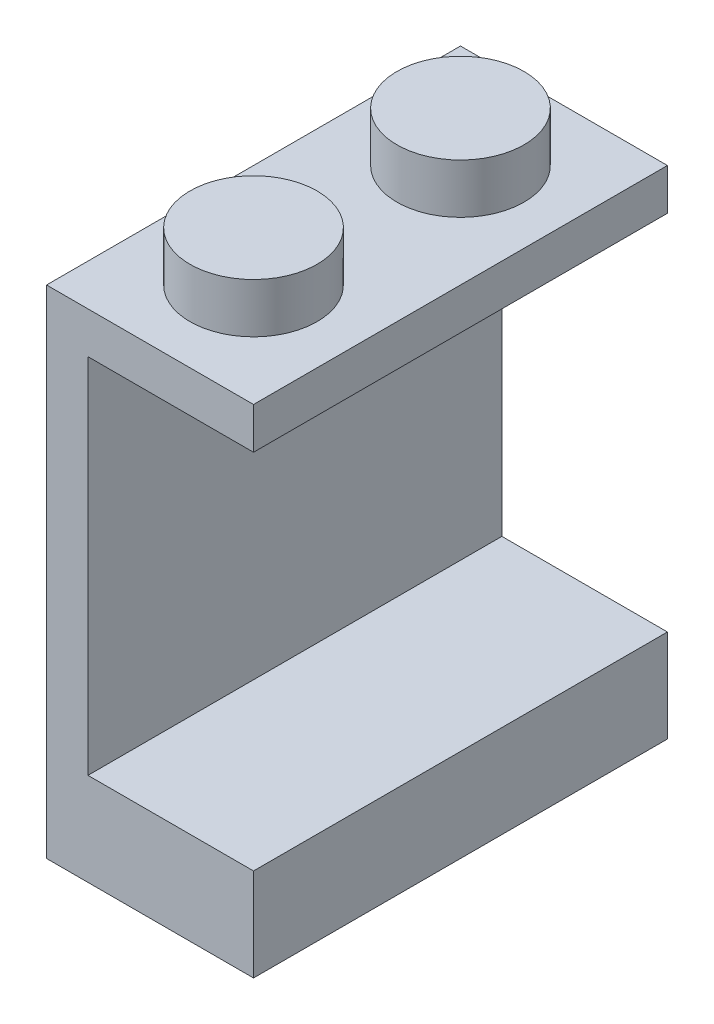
ISO-10303-21;
HEADER;
FILE_DESCRIPTION(('STEP AP214'),'2;1');
FILE_NAME('part.step','',(''),(''),'','','');
FILE_SCHEMA(('AUTOMOTIVE_DESIGN { 1 0 10303 214 1 1 1 1 }'));
ENDSEC;
DATA;
#1=APPLICATION_CONTEXT('core data for automotive mechanical design processes');
#2=APPLICATION_PROTOCOL_DEFINITION('international standard','automotive_design',2000,#1);
#3=PRODUCT_CONTEXT('',#1,'mechanical');
#4=PRODUCT('Part','Part','',(#3));
#5=PRODUCT_RELATED_PRODUCT_CATEGORY('part','',(#4));
#6=PRODUCT_DEFINITION_FORMATION('','',#4);
#7=PRODUCT_DEFINITION_CONTEXT('part definition',#1,'design');
#8=PRODUCT_DEFINITION('design','',#6,#7);
#9=PRODUCT_DEFINITION_SHAPE('','',#8);
#10=(LENGTH_UNIT() NAMED_UNIT(*) SI_UNIT(.MILLI.,.METRE.));
#11=(NAMED_UNIT(*) PLANE_ANGLE_UNIT() SI_UNIT($,.RADIAN.));
#12=(NAMED_UNIT(*) SI_UNIT($,.STERADIAN.) SOLID_ANGLE_UNIT());
#13=UNCERTAINTY_MEASURE_WITH_UNIT(LENGTH_MEASURE(1.E-05),#10,'distance_accuracy_value','');
#14=(GEOMETRIC_REPRESENTATION_CONTEXT(3) GLOBAL_UNCERTAINTY_ASSIGNED_CONTEXT((#13)) GLOBAL_UNIT_ASSIGNED_CONTEXT((#10,
#11,#12)) REPRESENTATION_CONTEXT('',''));
#15=CARTESIAN_POINT('',(0.,0.,0.));
#16=DIRECTION('',(0.,0.,1.));
#17=DIRECTION('',(1.,0.,0.));
#18=AXIS2_PLACEMENT_3D('',#15,#16,#17);
#19=CARTESIAN_POINT('',(3.96875,19.05,7.9375));
#20=DIRECTION('',(-1.,0.,0.));
#21=DIRECTION('',(0.,0.,1.));
#22=AXIS2_PLACEMENT_3D('',#19,#20,#21);
#23=PLANE('',#22);
#24=DIRECTION('',(0.,-1.,0.));
#25=VECTOR('',#24,1.);
#26=CARTESIAN_POINT('',(3.96875,19.05,-7.9375));
#27=LINE('',#26,#25);
#28=CARTESIAN_POINT('',(3.96875,3.556,-7.9375));
#29=VERTEX_POINT('',#28);
#30=CARTESIAN_POINT('',(3.96875,0.,-7.9375));
#31=VERTEX_POINT('',#30);
#32=EDGE_CURVE('E144',#29,#31,#27,.T.);
#33=ORIENTED_EDGE('',*,*,#32,.F.);
#34=DIRECTION('',(0.,0.,1.));
#35=VECTOR('',#34,1.);
#36=CARTESIAN_POINT('',(3.96875,3.556,-7.9375));
#37=LINE('',#36,#35);
#38=CARTESIAN_POINT('',(3.96875,3.556,7.93749999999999));
#39=VERTEX_POINT('',#38);
#40=EDGE_CURVE('E130',#29,#39,#37,.T.);
#41=ORIENTED_EDGE('',*,*,#40,.T.);
#42=DIRECTION('',(0.,-1.,0.));
#43=VECTOR('',#42,1.);
#44=CARTESIAN_POINT('',(3.96875,19.05,7.9375));
#45=LINE('',#44,#43);
#46=CARTESIAN_POINT('',(3.96875,0.,7.9375));
#47=VERTEX_POINT('',#46);
#48=EDGE_CURVE('E142',#39,#47,#45,.T.);
#49=ORIENTED_EDGE('',*,*,#48,.T.);
#50=DIRECTION('',(0.,0.,-1.));
#51=VECTOR('',#50,1.);
#52=CARTESIAN_POINT('',(3.96875,0.,7.9375));
#53=LINE('',#52,#51);
#54=EDGE_CURVE('E494',#47,#31,#53,.T.);
#55=ORIENTED_EDGE('',*,*,#54,.T.);
#56=EDGE_LOOP('',(#33,#41,#49,#55));
#57=FACE_BOUND('',#56,.T.);
#58=ADVANCED_FACE('F38',(#57),#23,.F.);
#59=CARTESIAN_POINT('',(-3.96875,19.05,7.9375));
#60=DIRECTION('',(0.,-1.,0.));
#61=DIRECTION('',(0.,0.,-1.));
#62=AXIS2_PLACEMENT_3D('',#59,#60,#61);
#63=PLANE('',#62);
#64=CARTESIAN_POINT('',(0.,19.05,3.96875));
#65=DIRECTION('',(0.,-1.,0.));
#66=DIRECTION('',(0.,0.,-1.));
#67=AXIS2_PLACEMENT_3D('',#64,#65,#66);
#68=CIRCLE('',#67,2.4384);
#69=CARTESIAN_POINT('',(0.,19.05,1.53035));
#70=VERTEX_POINT('',#69);
#71=EDGE_CURVE('E161',#70,#70,#68,.F.);
#72=ORIENTED_EDGE('',*,*,#71,.F.);
#73=EDGE_LOOP('',(#72));
#74=FACE_BOUND('',#73,.T.);
#75=DIRECTION('',(0.,0.,1.));
#76=VECTOR('',#75,1.);
#77=CARTESIAN_POINT('',(-3.96875,19.05,-7.9375));
#78=LINE('',#77,#76);
#79=CARTESIAN_POINT('',(-3.96875,19.05,-7.9375));
#80=VERTEX_POINT('',#79);
#81=CARTESIAN_POINT('',(-3.96875,19.05,7.9375));
#82=VERTEX_POINT('',#81);
#83=EDGE_CURVE('E499',#80,#82,#78,.T.);
#84=ORIENTED_EDGE('',*,*,#83,.T.);
#85=DIRECTION('',(-1.,0.,0.));
#86=VECTOR('',#85,1.);
#87=CARTESIAN_POINT('',(3.96875,19.05,7.9375));
#88=LINE('',#87,#86);
#89=CARTESIAN_POINT('',(3.96875,19.05,7.9375));
#90=VERTEX_POINT('',#89);
#91=EDGE_CURVE('E501',#90,#82,#88,.T.);
#92=ORIENTED_EDGE('',*,*,#91,.F.);
#93=DIRECTION('',(0.,0.,-1.));
#94=VECTOR('',#93,1.);
#95=CARTESIAN_POINT('',(3.96875,19.05,7.9375));
#96=LINE('',#95,#94);
#97=CARTESIAN_POINT('',(3.96875,19.05,-7.9375));
#98=VERTEX_POINT('',#97);
#99=EDGE_CURVE('E504',#90,#98,#96,.T.);
#100=ORIENTED_EDGE('',*,*,#99,.T.);
#101=DIRECTION('',(1.,0.,0.));
#102=VECTOR('',#101,1.);
#103=CARTESIAN_POINT('',(-3.96875,19.05,-7.9375));
#104=LINE('',#103,#102);
#105=EDGE_CURVE('E506',#80,#98,#104,.T.);
#106=ORIENTED_EDGE('',*,*,#105,.F.);
#107=EDGE_LOOP('',(#84,#92,#100,#106));
#108=FACE_BOUND('',#107,.T.);
#109=CARTESIAN_POINT('',(0.,19.05,-3.96875));
#110=DIRECTION('',(0.,-1.,0.));
#111=DIRECTION('',(0.,0.,-1.));
#112=AXIS2_PLACEMENT_3D('',#109,#110,#111);
#113=CIRCLE('',#112,2.4384);
#114=CARTESIAN_POINT('',(0.,19.05,-6.40715));
#115=VERTEX_POINT('',#114);
#116=EDGE_CURVE('E46',#115,#115,#113,.F.);
#117=ORIENTED_EDGE('',*,*,#116,.F.);
#118=EDGE_LOOP('',(#117));
#119=FACE_BOUND('',#118,.T.);
#120=ADVANCED_FACE('F168',(#74,#108,#119),#63,.F.);
#121=CARTESIAN_POINT('',(-3.96875,19.05,-7.9375));
#122=DIRECTION('',(1.,0.,0.));
#123=DIRECTION('',(0.,0.,-1.));
#124=AXIS2_PLACEMENT_3D('',#121,#122,#123);
#125=PLANE('',#124);
#126=DIRECTION('',(0.,0.,1.));
#127=VECTOR('',#126,1.);
#128=CARTESIAN_POINT('',(-3.96875,0.,-7.9375));
#129=LINE('',#128,#127);
#130=CARTESIAN_POINT('',(-3.96875,0.,-7.9375));
#131=VERTEX_POINT('',#130);
#132=CARTESIAN_POINT('',(-3.96875,0.,7.9375));
#133=VERTEX_POINT('',#132);
#134=EDGE_CURVE('E490',#131,#133,#129,.T.);
#135=ORIENTED_EDGE('',*,*,#134,.T.);
#136=DIRECTION('',(0.,-1.,0.));
#137=VECTOR('',#136,1.);
#138=CARTESIAN_POINT('',(-3.96875,19.05,7.9375));
#139=LINE('',#138,#137);
#140=EDGE_CURVE('E155',#82,#133,#139,.T.);
#141=ORIENTED_EDGE('',*,*,#140,.F.);
#142=ORIENTED_EDGE('',*,*,#83,.F.);
#143=DIRECTION('',(0.,-1.,0.));
#144=VECTOR('',#143,1.);
#145=CARTESIAN_POINT('',(-3.96875,19.05,-7.9375));
#146=LINE('',#145,#144);
#147=EDGE_CURVE('E508',#80,#131,#146,.T.);
#148=ORIENTED_EDGE('',*,*,#147,.T.);
#149=EDGE_LOOP('',(#135,#141,#142,#148));
#150=FACE_BOUND('',#149,.T.);
#151=ADVANCED_FACE('F40',(#150),#125,.F.);
#152=CARTESIAN_POINT('',(3.96875,19.05,7.9375));
#153=DIRECTION('',(0.,0.,1.));
#154=DIRECTION('',(1.,0.,0.));
#155=AXIS2_PLACEMENT_3D('',#152,#153,#154);
#156=PLANE('',#155);
#157=DIRECTION('',(1.,0.,0.));
#158=VECTOR('',#157,1.);
#159=CARTESIAN_POINT('',(-2.38125,3.556,7.93749999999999));
#160=LINE('',#159,#158);
#161=CARTESIAN_POINT('',(-2.38125,3.556,7.93749999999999));
#162=VERTEX_POINT('',#161);
#163=EDGE_CURVE('E126',#162,#39,#160,.T.);
#164=ORIENTED_EDGE('',*,*,#163,.F.);
#165=DIRECTION('',(0.,1.,0.));
#166=VECTOR('',#165,1.);
#167=CARTESIAN_POINT('',(-2.38125,3.556,7.93749999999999));
#168=LINE('',#167,#166);
#169=CARTESIAN_POINT('',(-2.38125,17.4625,7.93749999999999));
#170=VERTEX_POINT('',#169);
#171=EDGE_CURVE('E137',#162,#170,#168,.T.);
#172=ORIENTED_EDGE('',*,*,#171,.T.);
#173=DIRECTION('',(-1.,0.,0.));
#174=VECTOR('',#173,1.);
#175=CARTESIAN_POINT('',(3.96875,17.4625,7.93749999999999));
#176=LINE('',#175,#174);
#177=CARTESIAN_POINT('',(3.96875,17.4625,7.93749999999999));
#178=VERTEX_POINT('',#177);
#179=EDGE_CURVE('E430',#178,#170,#176,.T.);
#180=ORIENTED_EDGE('',*,*,#179,.F.);
#181=EDGE_CURVE('E151',#90,#178,#45,.T.);
#182=ORIENTED_EDGE('',*,*,#181,.F.);
#183=ORIENTED_EDGE('',*,*,#91,.T.);
#184=ORIENTED_EDGE('',*,*,#140,.T.);
#185=DIRECTION('',(-1.,0.,0.));
#186=VECTOR('',#185,1.);
#187=CARTESIAN_POINT('',(3.96875,0.,7.9375));
#188=LINE('',#187,#186);
#189=EDGE_CURVE('E150',#47,#133,#188,.T.);
#190=ORIENTED_EDGE('',*,*,#189,.F.);
#191=ORIENTED_EDGE('',*,*,#48,.F.);
#192=EDGE_LOOP('',(#164,#172,#180,#182,#183,#184,#190,#191));
#193=FACE_BOUND('',#192,.T.);
#194=ADVANCED_FACE('F148',(#193),#156,.T.);
#195=ORIENTED_EDGE('',*,*,#181,.T.);
#196=DIRECTION('',(0.,0.,1.));
#197=VECTOR('',#196,1.);
#198=CARTESIAN_POINT('',(3.96875,17.4625,-7.9375));
#199=LINE('',#198,#197);
#200=CARTESIAN_POINT('',(3.96875,17.4625,-7.9375));
#201=VERTEX_POINT('',#200);
#202=EDGE_CURVE('E432',#201,#178,#199,.T.);
#203=ORIENTED_EDGE('',*,*,#202,.F.);
#204=EDGE_CURVE('E152',#98,#201,#27,.T.);
#205=ORIENTED_EDGE('',*,*,#204,.F.);
#206=ORIENTED_EDGE('',*,*,#99,.F.);
#207=EDGE_LOOP('',(#195,#203,#205,#206));
#208=FACE_BOUND('',#207,.T.);
#209=ADVANCED_FACE('F178',(#208),#23,.F.);
#210=CARTESIAN_POINT('',(-3.96875,19.05,-7.9375));
#211=DIRECTION('',(0.,0.,-1.));
#212=DIRECTION('',(-1.,0.,0.));
#213=AXIS2_PLACEMENT_3D('',#210,#211,#212);
#214=PLANE('',#213);
#215=DIRECTION('',(1.,0.,0.));
#216=VECTOR('',#215,1.);
#217=CARTESIAN_POINT('',(-2.38125,3.556,-7.9375));
#218=LINE('',#217,#216);
#219=CARTESIAN_POINT('',(-2.38125,3.556,-7.9375));
#220=VERTEX_POINT('',#219);
#221=EDGE_CURVE('E433',#220,#29,#218,.T.);
#222=ORIENTED_EDGE('',*,*,#221,.T.);
#223=ORIENTED_EDGE('',*,*,#32,.T.);
#224=DIRECTION('',(1.,0.,0.));
#225=VECTOR('',#224,1.);
#226=CARTESIAN_POINT('',(-3.96875,0.,-7.9375));
#227=LINE('',#226,#225);
#228=EDGE_CURVE('E496',#131,#31,#227,.T.);
#229=ORIENTED_EDGE('',*,*,#228,.F.);
#230=ORIENTED_EDGE('',*,*,#147,.F.);
#231=ORIENTED_EDGE('',*,*,#105,.T.);
#232=ORIENTED_EDGE('',*,*,#204,.T.);
#233=DIRECTION('',(-1.,0.,0.));
#234=VECTOR('',#233,1.);
#235=CARTESIAN_POINT('',(3.96875,17.4625,-7.9375));
#236=LINE('',#235,#234);
#237=CARTESIAN_POINT('',(-2.38125,17.4625,-7.9375));
#238=VERTEX_POINT('',#237);
#239=EDGE_CURVE('E440',#201,#238,#236,.T.);
#240=ORIENTED_EDGE('',*,*,#239,.T.);
#241=DIRECTION('',(0.,1.,0.));
#242=VECTOR('',#241,1.);
#243=CARTESIAN_POINT('',(-2.38125,3.556,-7.9375));
#244=LINE('',#243,#242);
#245=EDGE_CURVE('E438',#220,#238,#244,.T.);
#246=ORIENTED_EDGE('',*,*,#245,.F.);
#247=EDGE_LOOP('',(#222,#223,#229,#230,#231,#232,#240,#246));
#248=FACE_BOUND('',#247,.T.);
#249=ADVANCED_FACE('F185',(#248),#214,.T.);
#250=CARTESIAN_POINT('',(-3.96875,0.,7.9375));
#251=DIRECTION('',(0.,-1.,0.));
#252=DIRECTION('',(0.,0.,-1.));
#253=AXIS2_PLACEMENT_3D('',#250,#251,#252);
#254=PLANE('',#253);
#255=DIRECTION('',(-1.,0.,0.));
#256=VECTOR('',#255,1.);
#257=CARTESIAN_POINT('',(2.38125,0.,6.35));
#258=LINE('',#257,#256);
#259=CARTESIAN_POINT('',(2.38125,0.,6.35));
#260=VERTEX_POINT('',#259);
#261=CARTESIAN_POINT('',(-2.38125,0.,6.35));
#262=VERTEX_POINT('',#261);
#263=EDGE_CURVE('E61',#260,#262,#258,.T.);
#264=ORIENTED_EDGE('',*,*,#263,.F.);
#265=DIRECTION('',(0.,0.,1.));
#266=VECTOR('',#265,1.);
#267=CARTESIAN_POINT('',(2.38125,0.,-6.35));
#268=LINE('',#267,#266);
#269=CARTESIAN_POINT('',(2.38125,0.,-6.35));
#270=VERTEX_POINT('',#269);
#271=EDGE_CURVE('E461',#270,#260,#268,.T.);
#272=ORIENTED_EDGE('',*,*,#271,.F.);
#273=DIRECTION('',(1.,0.,0.));
#274=VECTOR('',#273,1.);
#275=CARTESIAN_POINT('',(-2.38125,0.,-6.35));
#276=LINE('',#275,#274);
#277=CARTESIAN_POINT('',(-2.38125,0.,-6.35));
#278=VERTEX_POINT('',#277);
#279=EDGE_CURVE('E458',#278,#270,#276,.T.);
#280=ORIENTED_EDGE('',*,*,#279,.F.);
#281=DIRECTION('',(0.,0.,-1.));
#282=VECTOR('',#281,1.);
#283=CARTESIAN_POINT('',(-2.38125,0.,6.35));
#284=LINE('',#283,#282);
#285=EDGE_CURVE('E455',#262,#278,#284,.T.);
#286=ORIENTED_EDGE('',*,*,#285,.F.);
#287=EDGE_LOOP('',(#264,#272,#280,#286));
#288=FACE_BOUND('',#287,.T.);
#289=ORIENTED_EDGE('',*,*,#134,.F.);
#290=ORIENTED_EDGE('',*,*,#228,.T.);
#291=ORIENTED_EDGE('',*,*,#54,.F.);
#292=ORIENTED_EDGE('',*,*,#189,.T.);
#293=EDGE_LOOP('',(#289,#290,#291,#292));
#294=FACE_BOUND('',#293,.T.);
#295=ADVANCED_FACE('F183',(#288,#294),#254,.T.);
#296=CARTESIAN_POINT('',(0.,20.955,3.96875));
#297=DIRECTION('',(0.,-1.,0.));
#298=DIRECTION('',(0.,0.,-1.));
#299=AXIS2_PLACEMENT_3D('',#296,#297,#298);
#300=CYLINDRICAL_SURFACE('',#299,2.4384);
#301=CARTESIAN_POINT('',(0.,20.955,3.96875));
#302=DIRECTION('',(0.,1.,0.));
#303=DIRECTION('',(0.,0.,1.));
#304=AXIS2_PLACEMENT_3D('',#301,#302,#303);
#305=CIRCLE('',#304,2.4384);
#306=CARTESIAN_POINT('',(0.,20.955,1.53035));
#307=VERTEX_POINT('',#306);
#308=EDGE_CURVE('E487',#307,#307,#305,.T.);
#309=CARTESIAN_POINT('',(0.,20.955,1.53035));
#310=CARTESIAN_POINT('',(0.,20.93515625,1.53035));
#311=CARTESIAN_POINT('',(0.,20.9153125,1.53035));
#312=CARTESIAN_POINT('',(0.,20.875625,1.53035));
#313=CARTESIAN_POINT('',(0.,20.85578125,1.53035));
#314=CARTESIAN_POINT('',(0.,20.81609375,1.53035));
#315=CARTESIAN_POINT('',(0.,20.79625,1.53035));
#316=CARTESIAN_POINT('',(0.,20.7565625,1.53035));
#317=CARTESIAN_POINT('',(0.,20.73671875,1.53035));
#318=CARTESIAN_POINT('',(0.,20.69703125,1.53035));
#319=CARTESIAN_POINT('',(0.,20.6771875,1.53035));
#320=CARTESIAN_POINT('',(0.,20.6375,1.53035));
#321=CARTESIAN_POINT('',(0.,20.61765625,1.53035));
#322=CARTESIAN_POINT('',(0.,20.57796875,1.53035));
#323=CARTESIAN_POINT('',(0.,20.558125,1.53035));
#324=CARTESIAN_POINT('',(0.,20.5184375,1.53035));
#325=CARTESIAN_POINT('',(0.,20.49859375,1.53035));
#326=CARTESIAN_POINT('',(0.,20.45890625,1.53035));
#327=CARTESIAN_POINT('',(0.,20.4390625,1.53035));
#328=CARTESIAN_POINT('',(0.,20.399375,1.53035));
#329=CARTESIAN_POINT('',(0.,20.37953125,1.53035));
#330=CARTESIAN_POINT('',(0.,20.33984375,1.53035));
#331=CARTESIAN_POINT('',(0.,20.32,1.53035));
#332=CARTESIAN_POINT('',(0.,20.2803125,1.53035));
#333=CARTESIAN_POINT('',(0.,20.26046875,1.53035));
#334=CARTESIAN_POINT('',(0.,20.22078125,1.53035));
#335=CARTESIAN_POINT('',(0.,20.2009375,1.53035));
#336=CARTESIAN_POINT('',(0.,20.16125,1.53035));
#337=CARTESIAN_POINT('',(0.,20.14140625,1.53035));
#338=CARTESIAN_POINT('',(0.,20.10171875,1.53035));
#339=CARTESIAN_POINT('',(0.,20.081875,1.53035));
#340=CARTESIAN_POINT('',(0.,20.0421875,1.53035));
#341=CARTESIAN_POINT('',(0.,20.02234375,1.53035));
#342=CARTESIAN_POINT('',(0.,19.98265625,1.53035));
#343=CARTESIAN_POINT('',(0.,19.9628125,1.53035));
#344=CARTESIAN_POINT('',(0.,19.923125,1.53035));
#345=CARTESIAN_POINT('',(0.,19.90328125,1.53035));
#346=CARTESIAN_POINT('',(0.,19.86359375,1.53035));
#347=CARTESIAN_POINT('',(0.,19.84375,1.53035));
#348=CARTESIAN_POINT('',(0.,19.8040625,1.53035));
#349=CARTESIAN_POINT('',(0.,19.78421875,1.53035));
#350=CARTESIAN_POINT('',(0.,19.74453125,1.53035));
#351=CARTESIAN_POINT('',(0.,19.7246875,1.53035));
#352=CARTESIAN_POINT('',(0.,19.685,1.53035));
#353=CARTESIAN_POINT('',(0.,19.66515625,1.53035));
#354=CARTESIAN_POINT('',(0.,19.62546875,1.53035));
#355=CARTESIAN_POINT('',(0.,19.605625,1.53035));
#356=CARTESIAN_POINT('',(0.,19.5659375,1.53035));
#357=CARTESIAN_POINT('',(0.,19.54609375,1.53035));
#358=CARTESIAN_POINT('',(0.,19.50640625,1.53035));
#359=CARTESIAN_POINT('',(0.,19.4865625,1.53035));
#360=CARTESIAN_POINT('',(0.,19.446875,1.53035));
#361=CARTESIAN_POINT('',(0.,19.42703125,1.53035));
#362=CARTESIAN_POINT('',(0.,19.38734375,1.53035));
#363=CARTESIAN_POINT('',(0.,19.3675,1.53035));
#364=CARTESIAN_POINT('',(0.,19.3278125,1.53035));
#365=CARTESIAN_POINT('',(0.,19.30796875,1.53035));
#366=CARTESIAN_POINT('',(0.,19.26828125,1.53035));
#367=CARTESIAN_POINT('',(0.,19.2484375,1.53035));
#368=CARTESIAN_POINT('',(0.,19.20875,1.53035));
#369=CARTESIAN_POINT('',(0.,19.18890625,1.53035));
#370=CARTESIAN_POINT('',(0.,19.14921875,1.53035));
#371=CARTESIAN_POINT('',(0.,19.129375,1.53035));
#372=CARTESIAN_POINT('',(0.,19.0896875,1.53035));
#373=CARTESIAN_POINT('',(0.,19.06984375,1.53035));
#374=CARTESIAN_POINT('',(0.,19.05,1.53035));
#375=B_SPLINE_CURVE_WITH_KNOTS('',3,(#309,#310,#311,#312,#313,#314,#315,#316,#317,#318,#319,
#320,#321,#322,#323,#324,#325,#326,#327,#328,#329,#330,#331,#332,#333,#334,#335,#336,#337,#338,
#339,#340,#341,#342,#343,#344,#345,#346,#347,#348,#349,#350,#351,#352,#353,#354,#355,#356,#357,
#358,#359,#360,#361,#362,#363,#364,#365,#366,#367,#368,#369,#370,#371,#372,#373,#374),
.UNSPECIFIED.,.F.,.F.,(4,2,2,2,2,2,2,2,2,2,2,2,2,2,2,2,2,2,2,2,2,2,2,2,2,2,2,2,2,2,2,2,4),(0.,
0.059531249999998,0.119062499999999,0.178593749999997,0.238124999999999,0.297656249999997,
0.357187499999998,0.416718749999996,0.476249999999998,0.535781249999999,0.595312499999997,
0.654843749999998,0.714374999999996,0.773906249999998,0.833437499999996,0.892968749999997,
0.952499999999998,1.01203125,1.0715625,1.13109375,1.190625,1.25015625,1.3096875,
1.36921874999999,1.42875,1.48828125,1.5478125,1.60734375,1.66687499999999,1.72640625,
1.78593749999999,1.84546875,1.905),.UNSPECIFIED.);
#376=EDGE_CURVE('BSEAM209',#307,#70,#375,.T.);
#377=ORIENTED_EDGE('',*,*,#308,.F.);
#378=ORIENTED_EDGE('',*,*,#71,.T.);
#379=ORIENTED_EDGE('',*,*,#376,.T.);
#380=ORIENTED_EDGE('',*,*,#376,.F.);
#381=EDGE_LOOP('',(#377,#379,#378,#380));
#382=FACE_BOUND('',#381,.T.);
#383=ADVANCED_FACE('F209',(#382),#300,.T.);
#384=CARTESIAN_POINT('',(0.,20.955,3.96875));
#385=DIRECTION('',(0.,1.,0.));
#386=DIRECTION('',(0.,0.,1.));
#387=AXIS2_PLACEMENT_3D('',#384,#385,#386);
#388=PLANE('',#387);
#389=ORIENTED_EDGE('',*,*,#308,.T.);
#390=EDGE_LOOP('',(#389));
#391=FACE_BOUND('',#390,.T.);
#392=ADVANCED_FACE('F217',(#391),#388,.T.);
#393=CARTESIAN_POINT('',(0.,20.955,-3.96875));
#394=DIRECTION('',(0.,-1.,0.));
#395=DIRECTION('',(0.,0.,-1.));
#396=AXIS2_PLACEMENT_3D('',#393,#394,#395);
#397=CYLINDRICAL_SURFACE('',#396,2.4384);
#398=CARTESIAN_POINT('',(0.,20.955,-3.96875));
#399=DIRECTION('',(0.,1.,0.));
#400=DIRECTION('',(0.,0.,1.));
#401=AXIS2_PLACEMENT_3D('',#398,#399,#400);
#402=CIRCLE('',#401,2.4384);
#403=CARTESIAN_POINT('',(0.,20.955,-6.40715));
#404=VERTEX_POINT('',#403);
#405=EDGE_CURVE('E479',#404,#404,#402,.T.);
#406=CARTESIAN_POINT('',(0.,20.955,-6.40715));
#407=CARTESIAN_POINT('',(0.,20.93515625,-6.40715));
#408=CARTESIAN_POINT('',(0.,20.9153125,-6.40715));
#409=CARTESIAN_POINT('',(0.,20.875625,-6.40715));
#410=CARTESIAN_POINT('',(0.,20.85578125,-6.40715));
#411=CARTESIAN_POINT('',(0.,20.81609375,-6.40715));
#412=CARTESIAN_POINT('',(0.,20.79625,-6.40715));
#413=CARTESIAN_POINT('',(0.,20.7565625,-6.40715));
#414=CARTESIAN_POINT('',(0.,20.73671875,-6.40715));
#415=CARTESIAN_POINT('',(0.,20.69703125,-6.40715));
#416=CARTESIAN_POINT('',(0.,20.6771875,-6.40715));
#417=CARTESIAN_POINT('',(0.,20.6375,-6.40715));
#418=CARTESIAN_POINT('',(0.,20.61765625,-6.40715));
#419=CARTESIAN_POINT('',(0.,20.57796875,-6.40715));
#420=CARTESIAN_POINT('',(0.,20.558125,-6.40715));
#421=CARTESIAN_POINT('',(0.,20.5184375,-6.40715));
#422=CARTESIAN_POINT('',(0.,20.49859375,-6.40715));
#423=CARTESIAN_POINT('',(0.,20.45890625,-6.40715));
#424=CARTESIAN_POINT('',(0.,20.4390625,-6.40715));
#425=CARTESIAN_POINT('',(0.,20.399375,-6.40715));
#426=CARTESIAN_POINT('',(0.,20.37953125,-6.40715));
#427=CARTESIAN_POINT('',(0.,20.33984375,-6.40715));
#428=CARTESIAN_POINT('',(0.,20.32,-6.40715));
#429=CARTESIAN_POINT('',(0.,20.2803125,-6.40715));
#430=CARTESIAN_POINT('',(0.,20.26046875,-6.40715));
#431=CARTESIAN_POINT('',(0.,20.22078125,-6.40715));
#432=CARTESIAN_POINT('',(0.,20.2009375,-6.40715));
#433=CARTESIAN_POINT('',(0.,20.16125,-6.40715));
#434=CARTESIAN_POINT('',(0.,20.14140625,-6.40715));
#435=CARTESIAN_POINT('',(0.,20.10171875,-6.40715));
#436=CARTESIAN_POINT('',(0.,20.081875,-6.40715));
#437=CARTESIAN_POINT('',(0.,20.0421875,-6.40715));
#438=CARTESIAN_POINT('',(0.,20.02234375,-6.40715));
#439=CARTESIAN_POINT('',(0.,19.98265625,-6.40715));
#440=CARTESIAN_POINT('',(0.,19.9628125,-6.40715));
#441=CARTESIAN_POINT('',(0.,19.923125,-6.40715));
#442=CARTESIAN_POINT('',(0.,19.90328125,-6.40715));
#443=CARTESIAN_POINT('',(0.,19.86359375,-6.40715));
#444=CARTESIAN_POINT('',(0.,19.84375,-6.40715));
#445=CARTESIAN_POINT('',(0.,19.8040625,-6.40715));
#446=CARTESIAN_POINT('',(0.,19.78421875,-6.40715));
#447=CARTESIAN_POINT('',(0.,19.74453125,-6.40715));
#448=CARTESIAN_POINT('',(0.,19.7246875,-6.40715));
#449=CARTESIAN_POINT('',(0.,19.685,-6.40715));
#450=CARTESIAN_POINT('',(0.,19.66515625,-6.40715));
#451=CARTESIAN_POINT('',(0.,19.62546875,-6.40715));
#452=CARTESIAN_POINT('',(0.,19.605625,-6.40715));
#453=CARTESIAN_POINT('',(0.,19.5659375,-6.40715));
#454=CARTESIAN_POINT('',(0.,19.54609375,-6.40715));
#455=CARTESIAN_POINT('',(0.,19.50640625,-6.40715));
#456=CARTESIAN_POINT('',(0.,19.4865625,-6.40715));
#457=CARTESIAN_POINT('',(0.,19.446875,-6.40715));
#458=CARTESIAN_POINT('',(0.,19.42703125,-6.40715));
#459=CARTESIAN_POINT('',(0.,19.38734375,-6.40715));
#460=CARTESIAN_POINT('',(0.,19.3675,-6.40715));
#461=CARTESIAN_POINT('',(0.,19.3278125,-6.40715));
#462=CARTESIAN_POINT('',(0.,19.30796875,-6.40715));
#463=CARTESIAN_POINT('',(0.,19.26828125,-6.40715));
#464=CARTESIAN_POINT('',(0.,19.2484375,-6.40715));
#465=CARTESIAN_POINT('',(0.,19.20875,-6.40715));
#466=CARTESIAN_POINT('',(0.,19.18890625,-6.40715));
#467=CARTESIAN_POINT('',(0.,19.14921875,-6.40715));
#468=CARTESIAN_POINT('',(0.,19.129375,-6.40715));
#469=CARTESIAN_POINT('',(0.,19.0896875,-6.40715));
#470=CARTESIAN_POINT('',(0.,19.06984375,-6.40715));
#471=CARTESIAN_POINT('',(0.,19.05,-6.40715));
#472=B_SPLINE_CURVE_WITH_KNOTS('',3,(#406,#407,#408,#409,#410,#411,#412,#413,#414,#415,#416,
#417,#418,#419,#420,#421,#422,#423,#424,#425,#426,#427,#428,#429,#430,#431,#432,#433,#434,#435,
#436,#437,#438,#439,#440,#441,#442,#443,#444,#445,#446,#447,#448,#449,#450,#451,#452,#453,#454,
#455,#456,#457,#458,#459,#460,#461,#462,#463,#464,#465,#466,#467,#468,#469,#470,#471),
.UNSPECIFIED.,.F.,.F.,(4,2,2,2,2,2,2,2,2,2,2,2,2,2,2,2,2,2,2,2,2,2,2,2,2,2,2,2,2,2,2,2,4),(0.,
0.059531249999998,0.119062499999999,0.178593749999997,0.238124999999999,0.297656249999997,
0.357187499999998,0.416718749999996,0.476249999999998,0.535781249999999,0.595312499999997,
0.654843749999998,0.714374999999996,0.773906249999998,0.833437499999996,0.892968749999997,
0.952499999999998,1.01203125,1.0715625,1.13109375,1.190625,1.25015625,1.3096875,
1.36921874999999,1.42875,1.48828125,1.5478125,1.60734375,1.66687499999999,1.72640625,
1.78593749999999,1.84546875,1.905),.UNSPECIFIED.);
#473=EDGE_CURVE('BSEAM166',#404,#115,#472,.T.);
#474=ORIENTED_EDGE('',*,*,#405,.F.);
#475=ORIENTED_EDGE('',*,*,#116,.T.);
#476=ORIENTED_EDGE('',*,*,#473,.T.);
#477=ORIENTED_EDGE('',*,*,#473,.F.);
#478=EDGE_LOOP('',(#474,#476,#475,#477));
#479=FACE_BOUND('',#478,.T.);
#480=ADVANCED_FACE('F166',(#479),#397,.T.);
#481=CARTESIAN_POINT('',(0.,20.955,-3.96875));
#482=DIRECTION('',(0.,1.,0.));
#483=DIRECTION('',(0.,0.,1.));
#484=AXIS2_PLACEMENT_3D('',#481,#482,#483);
#485=PLANE('',#484);
#486=ORIENTED_EDGE('',*,*,#405,.T.);
#487=EDGE_LOOP('',(#486));
#488=FACE_BOUND('',#487,.T.);
#489=ADVANCED_FACE('F226',(#488),#485,.T.);
#490=CARTESIAN_POINT('',(2.38125,1.5875,6.35));
#491=DIRECTION('',(0.,0.,1.));
#492=DIRECTION('',(1.,0.,0.));
#493=AXIS2_PLACEMENT_3D('',#490,#491,#492);
#494=PLANE('',#493);
#495=ORIENTED_EDGE('',*,*,#263,.T.);
#496=DIRECTION('',(0.,-1.,0.));
#497=VECTOR('',#496,1.);
#498=CARTESIAN_POINT('',(-2.38125,1.5875,6.35));
#499=LINE('',#498,#497);
#500=CARTESIAN_POINT('',(-2.38125,1.5875,6.35));
#501=VERTEX_POINT('',#500);
#502=EDGE_CURVE('E476',#501,#262,#499,.T.);
#503=ORIENTED_EDGE('',*,*,#502,.F.);
#504=DIRECTION('',(-1.,0.,0.));
#505=VECTOR('',#504,1.);
#506=CARTESIAN_POINT('',(2.38125,1.5875,6.35));
#507=LINE('',#506,#505);
#508=CARTESIAN_POINT('',(2.38125,1.5875,6.35));
#509=VERTEX_POINT('',#508);
#510=EDGE_CURVE('E464',#509,#501,#507,.T.);
#511=ORIENTED_EDGE('',*,*,#510,.F.);
#512=DIRECTION('',(0.,-1.,0.));
#513=VECTOR('',#512,1.);
#514=CARTESIAN_POINT('',(2.38125,1.5875,6.35));
#515=LINE('',#514,#513);
#516=EDGE_CURVE('E477',#509,#260,#515,.T.);
#517=ORIENTED_EDGE('',*,*,#516,.T.);
#518=EDGE_LOOP('',(#495,#503,#511,#517));
#519=FACE_BOUND('',#518,.T.);
#520=ADVANCED_FACE('F234',(#519),#494,.F.);
#521=CARTESIAN_POINT('',(2.38125,1.5875,-6.35));
#522=DIRECTION('',(1.,0.,0.));
#523=DIRECTION('',(0.,0.,-1.));
#524=AXIS2_PLACEMENT_3D('',#521,#522,#523);
#525=PLANE('',#524);
#526=ORIENTED_EDGE('',*,*,#271,.T.);
#527=ORIENTED_EDGE('',*,*,#516,.F.);
#528=DIRECTION('',(0.,0.,1.));
#529=VECTOR('',#528,1.);
#530=CARTESIAN_POINT('',(2.38125,1.5875,-6.35));
#531=LINE('',#530,#529);
#532=CARTESIAN_POINT('',(2.38125,1.5875,-6.35));
#533=VERTEX_POINT('',#532);
#534=EDGE_CURVE('E473',#533,#509,#531,.T.);
#535=ORIENTED_EDGE('',*,*,#534,.F.);
#536=DIRECTION('',(0.,-1.,0.));
#537=VECTOR('',#536,1.);
#538=CARTESIAN_POINT('',(2.38125,1.5875,-6.35));
#539=LINE('',#538,#537);
#540=EDGE_CURVE('E480',#533,#270,#539,.T.);
#541=ORIENTED_EDGE('',*,*,#540,.T.);
#542=EDGE_LOOP('',(#526,#527,#535,#541));
#543=FACE_BOUND('',#542,.T.);
#544=ADVANCED_FACE('F245',(#543),#525,.F.);
#545=CARTESIAN_POINT('',(-2.38125,1.5875,-6.35));
#546=DIRECTION('',(0.,0.,-1.));
#547=DIRECTION('',(-1.,0.,0.));
#548=AXIS2_PLACEMENT_3D('',#545,#546,#547);
#549=PLANE('',#548);
#550=ORIENTED_EDGE('',*,*,#279,.T.);
#551=ORIENTED_EDGE('',*,*,#540,.F.);
#552=DIRECTION('',(1.,0.,0.));
#553=VECTOR('',#552,1.);
#554=CARTESIAN_POINT('',(-2.38125,1.5875,-6.35));
#555=LINE('',#554,#553);
#556=CARTESIAN_POINT('',(-2.38125,1.5875,-6.35));
#557=VERTEX_POINT('',#556);
#558=EDGE_CURVE('E470',#557,#533,#555,.T.);
#559=ORIENTED_EDGE('',*,*,#558,.F.);
#560=DIRECTION('',(0.,-1.,0.));
#561=VECTOR('',#560,1.);
#562=CARTESIAN_POINT('',(-2.38125,1.5875,-6.35));
#563=LINE('',#562,#561);
#564=EDGE_CURVE('E482',#557,#278,#563,.T.);
#565=ORIENTED_EDGE('',*,*,#564,.T.);
#566=EDGE_LOOP('',(#550,#551,#559,#565));
#567=FACE_BOUND('',#566,.T.);
#568=ADVANCED_FACE('F251',(#567),#549,.F.);
#569=CARTESIAN_POINT('',(-2.38125,1.5875,6.35));
#570=DIRECTION('',(-1.,0.,0.));
#571=DIRECTION('',(0.,0.,1.));
#572=AXIS2_PLACEMENT_3D('',#569,#570,#571);
#573=PLANE('',#572);
#574=ORIENTED_EDGE('',*,*,#285,.T.);
#575=ORIENTED_EDGE('',*,*,#564,.F.);
#576=DIRECTION('',(0.,0.,-1.));
#577=VECTOR('',#576,1.);
#578=CARTESIAN_POINT('',(-2.38125,1.5875,6.35));
#579=LINE('',#578,#577);
#580=EDGE_CURVE('E467',#501,#557,#579,.T.);
#581=ORIENTED_EDGE('',*,*,#580,.F.);
#582=ORIENTED_EDGE('',*,*,#502,.T.);
#583=EDGE_LOOP('',(#574,#575,#581,#582));
#584=FACE_BOUND('',#583,.T.);
#585=ADVANCED_FACE('F258',(#584),#573,.F.);
#586=CARTESIAN_POINT('',(-2.38125,1.5875,6.35));
#587=DIRECTION('',(0.,-1.,0.));
#588=DIRECTION('',(0.,0.,-1.));
#589=AXIS2_PLACEMENT_3D('',#586,#587,#588);
#590=PLANE('',#589);
#591=CARTESIAN_POINT('',(0.,1.5875,0.));
#592=DIRECTION('',(0.,-1.,0.));
#593=DIRECTION('',(0.,0.,-1.));
#594=AXIS2_PLACEMENT_3D('',#591,#592,#593);
#595=CIRCLE('',#594,2.032);
#596=CARTESIAN_POINT('',(0.,1.5875,-2.032));
#597=VERTEX_POINT('',#596);
#598=EDGE_CURVE('E11',#597,#597,#595,.T.);
#599=ORIENTED_EDGE('',*,*,#598,.F.);
#600=EDGE_LOOP('',(#599));
#601=FACE_BOUND('',#600,.T.);
#602=ORIENTED_EDGE('',*,*,#510,.T.);
#603=ORIENTED_EDGE('',*,*,#580,.T.);
#604=ORIENTED_EDGE('',*,*,#558,.T.);
#605=ORIENTED_EDGE('',*,*,#534,.T.);
#606=EDGE_LOOP('',(#602,#603,#604,#605));
#607=FACE_BOUND('',#606,.T.);
#608=ADVANCED_FACE('F265',(#601,#607),#590,.T.);
#609=CARTESIAN_POINT('',(0.,20.956,0.));
#610=DIRECTION('',(0.,-1.,0.));
#611=DIRECTION('',(0.,0.,-1.));
#612=AXIS2_PLACEMENT_3D('',#609,#610,#611);
#613=CYLINDRICAL_SURFACE('',#612,2.032);
#614=ORIENTED_EDGE('',*,*,#598,.T.);
#615=EDGE_LOOP('',(#614));
#616=FACE_BOUND('',#615,.T.);
#617=CARTESIAN_POINT('',(0.,0.,0.));
#618=DIRECTION('',(0.,-1.,0.));
#619=DIRECTION('',(1.,0.,0.));
#620=AXIS2_PLACEMENT_3D('',#617,#618,#619);
#621=CIRCLE('',#620,2.032);
#622=CARTESIAN_POINT('',(2.032,0.,0.));
#623=VERTEX_POINT('',#622);
#624=EDGE_CURVE('E449',#623,#623,#621,.T.);
#625=ORIENTED_EDGE('',*,*,#624,.F.);
#626=EDGE_LOOP('',(#625));
#627=FACE_BOUND('',#626,.T.);
#628=ADVANCED_FACE('F272',(#616,#627),#613,.T.);
#629=CARTESIAN_POINT('',(0.,0.,0.));
#630=DIRECTION('',(0.,-1.,0.));
#631=DIRECTION('',(0.,0.,-1.));
#632=AXIS2_PLACEMENT_3D('',#629,#630,#631);
#633=PLANE('',#632);
#634=CARTESIAN_POINT('',(0.,0.,0.));
#635=DIRECTION('',(0.,-1.,0.));
#636=DIRECTION('',(0.,0.,-1.));
#637=AXIS2_PLACEMENT_3D('',#634,#635,#636);
#638=CIRCLE('',#637,1.27);
#639=CARTESIAN_POINT('',(0.,0.,-1.27));
#640=VERTEX_POINT('',#639);
#641=EDGE_CURVE('E446',#640,#640,#638,.T.);
#642=ORIENTED_EDGE('',*,*,#641,.F.);
#643=EDGE_LOOP('',(#642));
#644=FACE_BOUND('',#643,.T.);
#645=ORIENTED_EDGE('',*,*,#624,.T.);
#646=EDGE_LOOP('',(#645));
#647=FACE_BOUND('',#646,.T.);
#648=ADVANCED_FACE('F281',(#644,#647),#633,.T.);
#649=CARTESIAN_POINT('',(0.,20.956,0.));
#650=DIRECTION('',(0.,-1.,0.));
#651=DIRECTION('',(0.,0.,-1.));
#652=AXIS2_PLACEMENT_3D('',#649,#650,#651);
#653=CYLINDRICAL_SURFACE('',#652,1.27);
#654=CARTESIAN_POINT('',(0.,1.5875,0.));
#655=DIRECTION('',(0.,-1.,0.));
#656=DIRECTION('',(0.,0.,-1.));
#657=AXIS2_PLACEMENT_3D('',#654,#655,#656);
#658=CIRCLE('',#657,1.27);
#659=CARTESIAN_POINT('',(0.,1.5875,-1.27));
#660=VERTEX_POINT('',#659);
#661=EDGE_CURVE('E145',#660,#660,#658,.F.);
#662=ORIENTED_EDGE('',*,*,#661,.T.);
#663=EDGE_LOOP('',(#662));
#664=FACE_BOUND('',#663,.T.);
#665=ORIENTED_EDGE('',*,*,#641,.T.);
#666=EDGE_LOOP('',(#665));
#667=FACE_BOUND('',#666,.T.);
#668=ADVANCED_FACE('F288',(#664,#667),#653,.F.);
#669=ORIENTED_EDGE('',*,*,#661,.F.);
#670=EDGE_LOOP('',(#669));
#671=FACE_BOUND('',#670,.T.);
#672=ADVANCED_FACE('F275',(#671),#590,.T.);
#673=CARTESIAN_POINT('',(-2.38125,3.556,-7.9375));
#674=DIRECTION('',(0.,-1.,0.));
#675=DIRECTION('',(0.,0.,-1.));
#676=AXIS2_PLACEMENT_3D('',#673,#674,#675);
#677=PLANE('',#676);
#678=ORIENTED_EDGE('',*,*,#163,.T.);
#679=ORIENTED_EDGE('',*,*,#40,.F.);
#680=ORIENTED_EDGE('',*,*,#221,.F.);
#681=DIRECTION('',(0.,0.,1.));
#682=VECTOR('',#681,1.);
#683=CARTESIAN_POINT('',(-2.38125,3.556,-7.9375));
#684=LINE('',#683,#682);
#685=EDGE_CURVE('E132',#220,#162,#684,.T.);
#686=ORIENTED_EDGE('',*,*,#685,.T.);
#687=EDGE_LOOP('',(#678,#679,#680,#686));
#688=FACE_BOUND('',#687,.T.);
#689=ADVANCED_FACE('F128',(#688),#677,.F.);
#690=CARTESIAN_POINT('',(-2.38125,3.556,-7.9375));
#691=DIRECTION('',(1.,0.,0.));
#692=DIRECTION('',(0.,0.,-1.));
#693=AXIS2_PLACEMENT_3D('',#690,#691,#692);
#694=PLANE('',#693);
#695=ORIENTED_EDGE('',*,*,#171,.F.);
#696=ORIENTED_EDGE('',*,*,#685,.F.);
#697=ORIENTED_EDGE('',*,*,#245,.T.);
#698=DIRECTION('',(0.,0.,1.));
#699=VECTOR('',#698,1.);
#700=CARTESIAN_POINT('',(-2.38125,17.4625,-7.9375));
#701=LINE('',#700,#699);
#702=EDGE_CURVE('E53',#238,#170,#701,.T.);
#703=ORIENTED_EDGE('',*,*,#702,.T.);
#704=EDGE_LOOP('',(#695,#696,#697,#703));
#705=FACE_BOUND('',#704,.T.);
#706=ADVANCED_FACE('F306',(#705),#694,.T.);
#707=CARTESIAN_POINT('',(3.96875,17.4625,-7.9375));
#708=DIRECTION('',(0.,1.,0.));
#709=DIRECTION('',(0.,0.,1.));
#710=AXIS2_PLACEMENT_3D('',#707,#708,#709);
#711=PLANE('',#710);
#712=ORIENTED_EDGE('',*,*,#179,.T.);
#713=ORIENTED_EDGE('',*,*,#702,.F.);
#714=ORIENTED_EDGE('',*,*,#239,.F.);
#715=ORIENTED_EDGE('',*,*,#202,.T.);
#716=EDGE_LOOP('',(#712,#713,#714,#715));
#717=FACE_BOUND('',#716,.T.);
#718=ADVANCED_FACE('F312',(#717),#711,.F.);
#719=CLOSED_SHELL('',(#58,#120,#151,#194,#209,#249,#295,#383,#392,#480,#489,#520,#544,#568,#585,
#608,#628,#648,#668,#672,#689,#706,#718));
#720=MANIFOLD_SOLID_BREP('B2',#719);
#721=ADVANCED_BREP_SHAPE_REPRESENTATION('',(#18,#720),#14);
#722=SHAPE_DEFINITION_REPRESENTATION(#9,#721);
ENDSEC;
END-ISO-10303-21;
